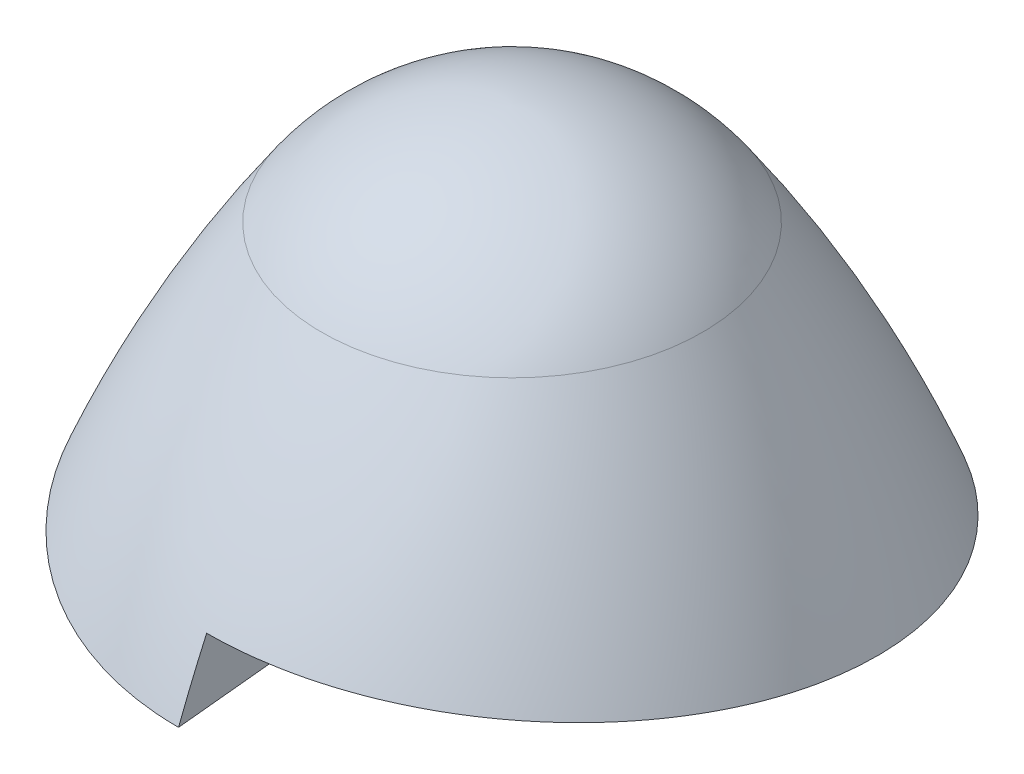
from build123d import *

# Parameters (mm, degrees)
ESQUISSE3_W             = 9.266041
ESQUISSE3_H             = 4.440045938
ENL_V_MAT_EXTRU_1_DEPTH = 10
ESQUISSE4_W             = 10.247352
ESQUISSE4_H             = 3.718440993
ENL_V_MAT_EXTRU_2_DEPTH = 10
ENL_V_MAT_EXTRU_3_DEPTH = 5


with BuildPart() as part:
    # Esquisse1 → R_volution1 (revolve)
    with BuildSketch(Plane.XY, mode=Mode.PRIVATE) as r_volution1_sk:
        with BuildLine():
            Line((0, 0), (8.5, 0))
            ThreePointArc((8.5, 0), (6.884457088, 3.557582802), (4.853582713, 6.895534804))
            ThreePointArc((4.853582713, 6.895534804), (2.739642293, 8.780784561), (0, 9.5))
            Line((0, 9.5), (0, 0))
        make_face()
    revolve(r_volution1_sk.sketch.rotate(Axis((0, 9.5, 0), (0, -1, 0)), 180), axis=Axis((0, 9.5, 0), (0, -1, 0)))

    # Esquisse3 → Enl_v. mat.-Extru.1 (cut, symmetric)
    with BuildSketch(Plane(origin=(0, 0, 0), x_dir=(1, 0, 0), z_dir=(0, -0.10452846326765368, 0.9945218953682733))):
        with Locations((-4.6330205, -1.331531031)):
            Rectangle(ESQUISSE3_W, ESQUISSE3_H)
    extrude(amount=ENL_V_MAT_EXTRU_1_DEPTH, both=True, mode=Mode.SUBTRACT)

    # Esquisse4 → Enl_v. mat.-Extru.2 (cut, symmetric)
    with BuildSketch(Plane(origin=(0, 0, 0), x_dir=(1, 0, 0), z_dir=(0, 0.10452846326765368, 0.9945218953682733))):
        with Locations((5.123676, -0.961798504)):
            Rectangle(ESQUISSE4_W, ESQUISSE4_H)
    extrude(amount=ENL_V_MAT_EXTRU_2_DEPTH, both=True, mode=Mode.SUBTRACT)

    # Esquisse6 → Enl_v. mat.-Extru.3 (cut)
    with BuildSketch(Plane(origin=(0, 0, 0), x_dir=(1, 0, 0), z_dir=(0, 1, 0))):
        with BuildLine():
            Line((4, 4), (4, -4))
            ThreePointArc((4, -4), (0, -5.656854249), (-4, -4))
            Line((-4, -4), (-4, 4))
            ThreePointArc((-4, 4), (0, 5.656854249), (4, 4))
        make_face()
    extrude(amount=ENL_V_MAT_EXTRU_3_DEPTH, mode=Mode.SUBTRACT)


solid = part.part
